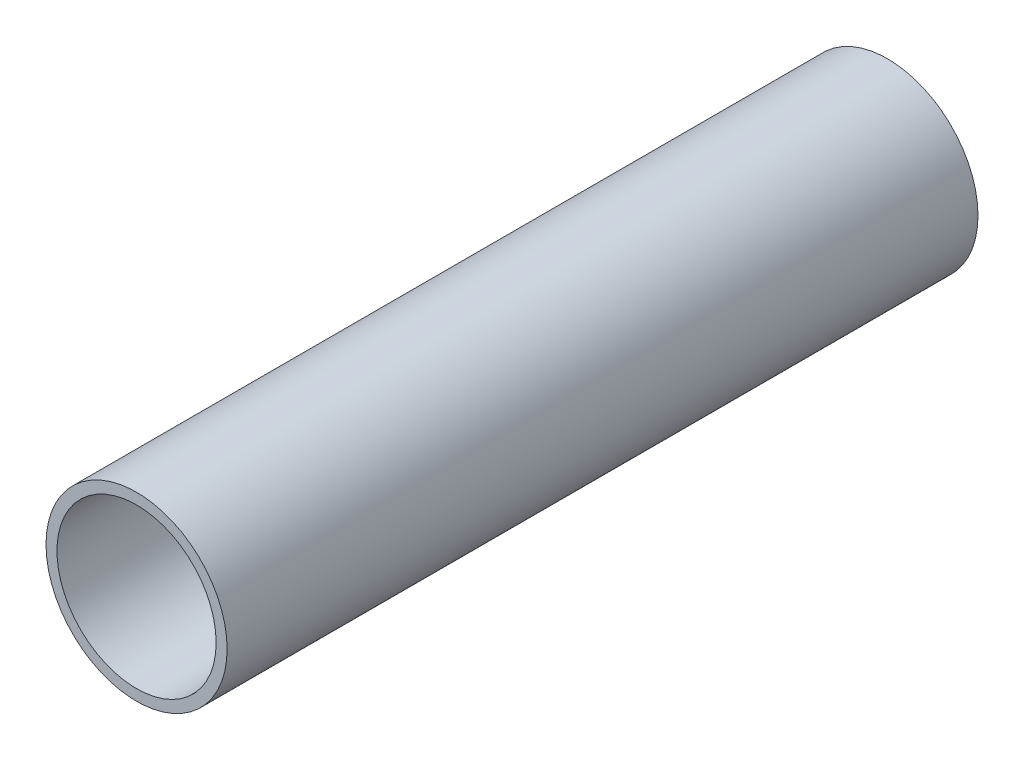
ISO-10303-21;
HEADER;
FILE_DESCRIPTION(('STEP AP214'),'2;1');
FILE_NAME('part.step','',(''),(''),'','','');
FILE_SCHEMA(('AUTOMOTIVE_DESIGN { 1 0 10303 214 1 1 1 1 }'));
ENDSEC;
DATA;
#1=APPLICATION_CONTEXT('core data for automotive mechanical design processes');
#2=APPLICATION_PROTOCOL_DEFINITION('international standard','automotive_design',2000,#1);
#3=PRODUCT_CONTEXT('',#1,'mechanical');
#4=PRODUCT('Part','Part','',(#3));
#5=PRODUCT_RELATED_PRODUCT_CATEGORY('part','',(#4));
#6=PRODUCT_DEFINITION_FORMATION('','',#4);
#7=PRODUCT_DEFINITION_CONTEXT('part definition',#1,'design');
#8=PRODUCT_DEFINITION('design','',#6,#7);
#9=PRODUCT_DEFINITION_SHAPE('','',#8);
#10=(LENGTH_UNIT() NAMED_UNIT(*) SI_UNIT(.MILLI.,.METRE.));
#11=(NAMED_UNIT(*) PLANE_ANGLE_UNIT() SI_UNIT($,.RADIAN.));
#12=(NAMED_UNIT(*) SI_UNIT($,.STERADIAN.) SOLID_ANGLE_UNIT());
#13=UNCERTAINTY_MEASURE_WITH_UNIT(LENGTH_MEASURE(1.E-05),#10,'distance_accuracy_value','');
#14=(GEOMETRIC_REPRESENTATION_CONTEXT(3) GLOBAL_UNCERTAINTY_ASSIGNED_CONTEXT((#13)) GLOBAL_UNIT_ASSIGNED_CONTEXT((#10,
#11,#12)) REPRESENTATION_CONTEXT('',''));
#15=CARTESIAN_POINT('',(0.,0.,0.));
#16=DIRECTION('',(0.,0.,1.));
#17=DIRECTION('',(1.,0.,0.));
#18=AXIS2_PLACEMENT_3D('',#15,#16,#17);
#19=CARTESIAN_POINT('',(9000.,2469.85,335.277077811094));
#20=DIRECTION('',(0.,0.,-1.));
#21=DIRECTION('',(-1.,0.,0.));
#22=AXIS2_PLACEMENT_3D('',#19,#20,#21);
#23=CYLINDRICAL_SURFACE('',#22,30.1499999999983);
#24=CARTESIAN_POINT('',(9000.,2469.85,0.));
#25=DIRECTION('',(0.,0.,1.));
#26=DIRECTION('',(1.,0.,0.));
#27=AXIS2_PLACEMENT_3D('',#24,#25,#26);
#28=CIRCLE('',#27,30.1499999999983);
#29=CARTESIAN_POINT('',(9030.15,2469.85,0.));
#30=VERTEX_POINT('',#29);
#31=EDGE_CURVE('E32',#30,#30,#28,.T.);
#32=ORIENTED_EDGE('',*,*,#31,.T.);
#33=EDGE_LOOP('',(#32));
#34=FACE_BOUND('',#33,.T.);
#35=CARTESIAN_POINT('',(9000.,2469.85,250.));
#36=DIRECTION('',(0.,0.,1.));
#37=DIRECTION('',(1.,0.,0.));
#38=AXIS2_PLACEMENT_3D('',#35,#36,#37);
#39=CIRCLE('',#38,30.15);
#40=CARTESIAN_POINT('',(9030.15,2469.85,250.));
#41=VERTEX_POINT('',#40);
#42=EDGE_CURVE('E36',#41,#41,#39,.T.);
#43=ORIENTED_EDGE('',*,*,#42,.F.);
#44=EDGE_LOOP('',(#43));
#45=FACE_BOUND('',#44,.T.);
#46=ADVANCED_FACE('F29',(#34,#45),#23,.T.);
#47=CARTESIAN_POINT('',(9000.,2469.85,0.));
#48=DIRECTION('',(0.,0.,1.));
#49=DIRECTION('',(1.,0.,0.));
#50=AXIS2_PLACEMENT_3D('',#47,#48,#49);
#51=PLANE('',#50);
#52=ORIENTED_EDGE('',*,*,#31,.F.);
#53=EDGE_LOOP('',(#52));
#54=FACE_BOUND('',#53,.T.);
#55=CARTESIAN_POINT('',(9000.,2469.85,0.));
#56=DIRECTION('',(0.,0.,1.));
#57=DIRECTION('',(1.,0.,0.));
#58=AXIS2_PLACEMENT_3D('',#55,#56,#57);
#59=CIRCLE('',#58,26.4999999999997);
#60=CARTESIAN_POINT('',(9026.5,2469.85,0.));
#61=VERTEX_POINT('',#60);
#62=EDGE_CURVE('E42',#61,#61,#59,.T.);
#63=ORIENTED_EDGE('',*,*,#62,.T.);
#64=EDGE_LOOP('',(#63));
#65=FACE_BOUND('',#64,.T.);
#66=ADVANCED_FACE('F51',(#54,#65),#51,.F.);
#67=CARTESIAN_POINT('',(9000.,2469.85,335.277077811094));
#68=DIRECTION('',(0.,0.,-1.));
#69=DIRECTION('',(-1.,0.,0.));
#70=AXIS2_PLACEMENT_3D('',#67,#68,#69);
#71=CYLINDRICAL_SURFACE('',#70,26.4999999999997);
#72=ORIENTED_EDGE('',*,*,#62,.F.);
#73=EDGE_LOOP('',(#72));
#74=FACE_BOUND('',#73,.T.);
#75=CARTESIAN_POINT('',(9000.,2469.85,250.));
#76=DIRECTION('',(0.,0.,1.));
#77=DIRECTION('',(1.,0.,0.));
#78=AXIS2_PLACEMENT_3D('',#75,#76,#77);
#79=CIRCLE('',#78,26.5);
#80=CARTESIAN_POINT('',(9026.5,2469.85,250.));
#81=VERTEX_POINT('',#80);
#82=EDGE_CURVE('E10',#81,#81,#79,.T.);
#83=ORIENTED_EDGE('',*,*,#82,.T.);
#84=EDGE_LOOP('',(#83));
#85=FACE_BOUND('',#84,.T.);
#86=ADVANCED_FACE('F53',(#74,#85),#71,.F.);
#87=CARTESIAN_POINT('',(9000.,2469.85,250.));
#88=DIRECTION('',(0.,0.,1.));
#89=DIRECTION('',(1.,0.,0.));
#90=AXIS2_PLACEMENT_3D('',#87,#88,#89);
#91=PLANE('',#90);
#92=ORIENTED_EDGE('',*,*,#82,.F.);
#93=EDGE_LOOP('',(#92));
#94=FACE_BOUND('',#93,.T.);
#95=ORIENTED_EDGE('',*,*,#42,.T.);
#96=EDGE_LOOP('',(#95));
#97=FACE_BOUND('',#96,.T.);
#98=ADVANCED_FACE('F58',(#94,#97),#91,.T.);
#99=CLOSED_SHELL('',(#46,#66,#86,#98));
#100=MANIFOLD_SOLID_BREP('B2',#99);
#101=ADVANCED_BREP_SHAPE_REPRESENTATION('',(#18,#100),#14);
#102=SHAPE_DEFINITION_REPRESENTATION(#9,#101);
ENDSEC;
END-ISO-10303-21;
